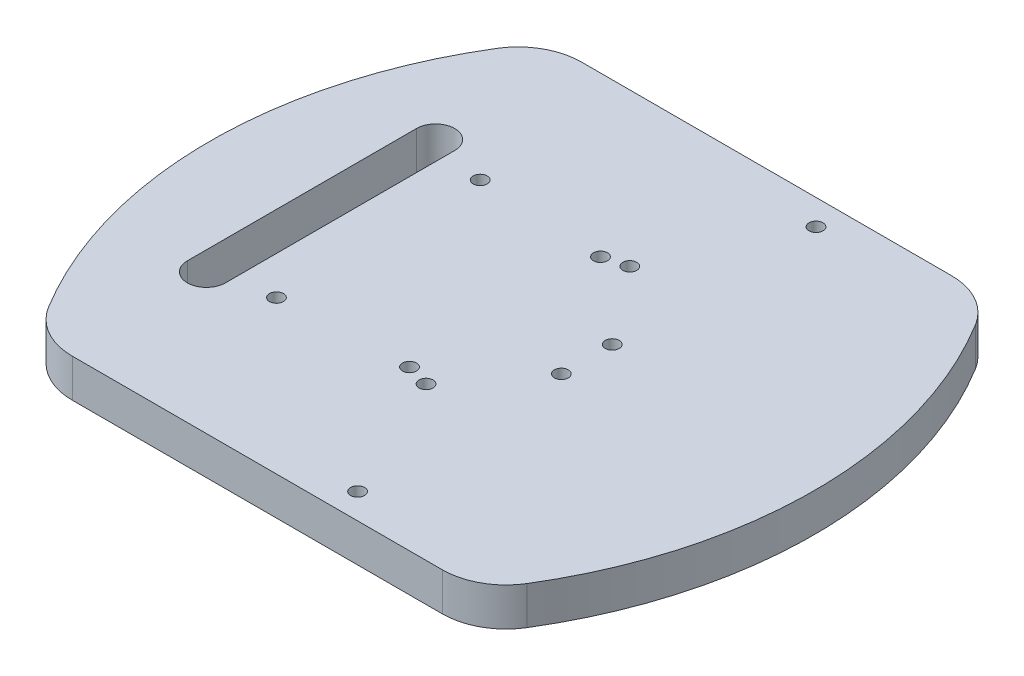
ISO-10303-21;
HEADER;
FILE_DESCRIPTION(('STEP AP214'),'2;1');
FILE_NAME('part.step','',(''),(''),'','','');
FILE_SCHEMA(('AUTOMOTIVE_DESIGN { 1 0 10303 214 1 1 1 1 }'));
ENDSEC;
DATA;
#1=APPLICATION_CONTEXT('core data for automotive mechanical design processes');
#2=APPLICATION_PROTOCOL_DEFINITION('international standard','automotive_design',2000,#1);
#3=PRODUCT_CONTEXT('',#1,'mechanical');
#4=PRODUCT('Part','Part','',(#3));
#5=PRODUCT_RELATED_PRODUCT_CATEGORY('part','',(#4));
#6=PRODUCT_DEFINITION_FORMATION('','',#4);
#7=PRODUCT_DEFINITION_CONTEXT('part definition',#1,'design');
#8=PRODUCT_DEFINITION('design','',#6,#7);
#9=PRODUCT_DEFINITION_SHAPE('','',#8);
#10=(LENGTH_UNIT() NAMED_UNIT(*) SI_UNIT(.MILLI.,.METRE.));
#11=(NAMED_UNIT(*) PLANE_ANGLE_UNIT() SI_UNIT($,.RADIAN.));
#12=(NAMED_UNIT(*) SI_UNIT($,.STERADIAN.) SOLID_ANGLE_UNIT());
#13=UNCERTAINTY_MEASURE_WITH_UNIT(LENGTH_MEASURE(1.E-05),#10,'distance_accuracy_value','');
#14=(GEOMETRIC_REPRESENTATION_CONTEXT(3) GLOBAL_UNCERTAINTY_ASSIGNED_CONTEXT((#13)) GLOBAL_UNIT_ASSIGNED_CONTEXT((#10,
#11,#12)) REPRESENTATION_CONTEXT('',''));
#15=CARTESIAN_POINT('',(0.,0.,0.));
#16=DIRECTION('',(0.,0.,1.));
#17=DIRECTION('',(1.,0.,0.));
#18=AXIS2_PLACEMENT_3D('',#15,#16,#17);
#19=CARTESIAN_POINT('',(-34.0535421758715,6.,30.));
#20=DIRECTION('',(0.,1.,0.));
#21=DIRECTION('',(0.,0.,1.));
#22=AXIS2_PLACEMENT_3D('',#19,#20,#21);
#23=PLANE('',#22);
#24=CARTESIAN_POINT('',(-6.1,6.,-15.));
#25=DIRECTION('',(0.,1.,0.));
#26=DIRECTION('',(0.,0.,1.));
#27=AXIS2_PLACEMENT_3D('',#24,#25,#26);
#28=CIRCLE('',#27,1.1);
#29=CARTESIAN_POINT('',(-6.1,6.,-13.9));
#30=VERTEX_POINT('',#29);
#31=EDGE_CURVE('E142',#30,#30,#28,.T.);
#32=ORIENTED_EDGE('',*,*,#31,.F.);
#33=EDGE_LOOP('',(#32));
#34=FACE_BOUND('',#33,.T.);
#35=CARTESIAN_POINT('',(-26.,6.,16.));
#36=DIRECTION('',(0.,1.,0.));
#37=DIRECTION('',(0.,0.,-1.));
#38=AXIS2_PLACEMENT_3D('',#35,#36,#37);
#39=CIRCLE('',#38,1.1);
#40=CARTESIAN_POINT('',(-26.,6.,14.9));
#41=VERTEX_POINT('',#40);
#42=EDGE_CURVE('E164',#41,#41,#39,.T.);
#43=ORIENTED_EDGE('',*,*,#42,.F.);
#44=EDGE_LOOP('',(#43));
#45=FACE_BOUND('',#44,.T.);
#46=CARTESIAN_POINT('',(-26.,6.,-16.));
#47=DIRECTION('',(0.,1.,0.));
#48=DIRECTION('',(0.,0.,1.));
#49=AXIS2_PLACEMENT_3D('',#46,#47,#48);
#50=CIRCLE('',#49,1.1);
#51=CARTESIAN_POINT('',(-26.,6.,-14.9));
#52=VERTEX_POINT('',#51);
#53=EDGE_CURVE('E176',#52,#52,#50,.T.);
#54=ORIENTED_EDGE('',*,*,#53,.F.);
#55=EDGE_LOOP('',(#54));
#56=FACE_BOUND('',#55,.T.);
#57=CARTESIAN_POINT('',(6.75,6.,4.));
#58=DIRECTION('',(0.,1.,0.));
#59=DIRECTION('',(0.,0.,1.));
#60=AXIS2_PLACEMENT_3D('',#57,#58,#59);
#61=CIRCLE('',#60,1.1);
#62=CARTESIAN_POINT('',(6.75,6.,5.1));
#63=VERTEX_POINT('',#62);
#64=EDGE_CURVE('E188',#63,#63,#61,.T.);
#65=ORIENTED_EDGE('',*,*,#64,.F.);
#66=EDGE_LOOP('',(#65));
#67=FACE_BOUND('',#66,.T.);
#68=CARTESIAN_POINT('',(6.75,6.,-4.));
#69=DIRECTION('',(0.,1.,0.));
#70=DIRECTION('',(0.,0.,-1.));
#71=AXIS2_PLACEMENT_3D('',#68,#69,#70);
#72=CIRCLE('',#71,1.1);
#73=CARTESIAN_POINT('',(6.75,6.,-5.1));
#74=VERTEX_POINT('',#73);
#75=EDGE_CURVE('E200',#74,#74,#72,.T.);
#76=ORIENTED_EDGE('',*,*,#75,.F.);
#77=EDGE_LOOP('',(#76));
#78=FACE_BOUND('',#77,.T.);
#79=CARTESIAN_POINT('',(-34.0535421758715,6.,30.));
#80=DIRECTION('',(0.,1.,0.));
#81=DIRECTION('',(0.,0.,1.));
#82=AXIS2_PLACEMENT_3D('',#79,#80,#81);
#83=CIRCLE('',#82,10.);
#84=CARTESIAN_POINT('',(-42.5845929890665,6.,35.2173913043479));
#85=VERTEX_POINT('',#84);
#86=CARTESIAN_POINT('',(-34.0535421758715,6.,40.));
#87=VERTEX_POINT('',#86);
#88=EDGE_CURVE('E226',#85,#87,#83,.T.);
#89=ORIENTED_EDGE('',*,*,#88,.T.);
#90=DIRECTION('',(1.,0.,0.));
#91=VECTOR('',#90,1.);
#92=CARTESIAN_POINT('',(-34.0535421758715,6.,40.));
#93=LINE('',#92,#91);
#94=CARTESIAN_POINT('',(24.0535421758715,6.,40.0000000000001));
#95=VERTEX_POINT('',#94);
#96=EDGE_CURVE('E229',#87,#95,#93,.T.);
#97=ORIENTED_EDGE('',*,*,#96,.T.);
#98=CARTESIAN_POINT('',(24.0535421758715,6.,30.0000000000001));
#99=DIRECTION('',(0.,1.,0.));
#100=DIRECTION('',(0.,0.,-1.));
#101=AXIS2_PLACEMENT_3D('',#98,#99,#100);
#102=CIRCLE('',#101,10.);
#103=CARTESIAN_POINT('',(32.5845929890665,6.,35.2173913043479));
#104=VERTEX_POINT('',#103);
#105=EDGE_CURVE('E231',#95,#104,#102,.T.);
#106=ORIENTED_EDGE('',*,*,#105,.T.);
#107=CARTESIAN_POINT('',(-25.,6.,0.));
#108=DIRECTION('',(0.,1.,0.));
#109=DIRECTION('',(0.,0.,1.));
#110=AXIS2_PLACEMENT_3D('',#107,#108,#109);
#111=CIRCLE('',#110,67.5);
#112=CARTESIAN_POINT('',(32.5845929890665,6.,-35.2173913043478));
#113=VERTEX_POINT('',#112);
#114=EDGE_CURVE('E233',#104,#113,#111,.T.);
#115=ORIENTED_EDGE('',*,*,#114,.T.);
#116=CARTESIAN_POINT('',(24.0535421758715,6.,-29.9999999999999));
#117=DIRECTION('',(0.,1.,0.));
#118=DIRECTION('',(0.,0.,-1.));
#119=AXIS2_PLACEMENT_3D('',#116,#117,#118);
#120=CIRCLE('',#119,10.);
#121=CARTESIAN_POINT('',(24.0535421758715,6.,-39.9999999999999));
#122=VERTEX_POINT('',#121);
#123=EDGE_CURVE('E235',#113,#122,#120,.T.);
#124=ORIENTED_EDGE('',*,*,#123,.T.);
#125=DIRECTION('',(-1.,0.,0.));
#126=VECTOR('',#125,1.);
#127=CARTESIAN_POINT('',(-34.0535421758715,6.,-40.));
#128=LINE('',#127,#126);
#129=CARTESIAN_POINT('',(-34.0535421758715,6.,-40.));
#130=VERTEX_POINT('',#129);
#131=EDGE_CURVE('E237',#122,#130,#128,.T.);
#132=ORIENTED_EDGE('',*,*,#131,.T.);
#133=CARTESIAN_POINT('',(-34.0535421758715,6.,-30.));
#134=DIRECTION('',(0.,1.,0.));
#135=DIRECTION('',(0.,0.,1.));
#136=AXIS2_PLACEMENT_3D('',#133,#134,#135);
#137=CIRCLE('',#136,10.);
#138=CARTESIAN_POINT('',(-42.5845929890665,6.,-35.2173913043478));
#139=VERTEX_POINT('',#138);
#140=EDGE_CURVE('E239',#130,#139,#137,.T.);
#141=ORIENTED_EDGE('',*,*,#140,.T.);
#142=CARTESIAN_POINT('',(15.,6.,0.));
#143=DIRECTION('',(0.,1.,0.));
#144=DIRECTION('',(0.,0.,-1.));
#145=AXIS2_PLACEMENT_3D('',#142,#143,#144);
#146=CIRCLE('',#145,67.5);
#147=EDGE_CURVE('E241',#139,#85,#146,.T.);
#148=ORIENTED_EDGE('',*,*,#147,.T.);
#149=EDGE_LOOP('',(#89,#97,#106,#115,#124,#132,#141,#148));
#150=FACE_BOUND('',#149,.T.);
#151=CARTESIAN_POINT('',(6.75,6.,-36.));
#152=DIRECTION('',(0.,1.,0.));
#153=DIRECTION('',(0.,0.,1.));
#154=AXIS2_PLACEMENT_3D('',#151,#152,#153);
#155=CIRCLE('',#154,1.1);
#156=CARTESIAN_POINT('',(6.75,6.,-34.9));
#157=VERTEX_POINT('',#156);
#158=EDGE_CURVE('E206',#157,#157,#155,.T.);
#159=ORIENTED_EDGE('',*,*,#158,.F.);
#160=EDGE_LOOP('',(#159));
#161=FACE_BOUND('',#160,.T.);
#162=CARTESIAN_POINT('',(6.75,6.,36.));
#163=DIRECTION('',(0.,1.,0.));
#164=DIRECTION('',(0.,0.,-1.));
#165=AXIS2_PLACEMENT_3D('',#162,#163,#164);
#166=CIRCLE('',#165,1.1);
#167=CARTESIAN_POINT('',(6.75,6.,34.9));
#168=VERTEX_POINT('',#167);
#169=EDGE_CURVE('E194',#168,#168,#166,.T.);
#170=ORIENTED_EDGE('',*,*,#169,.F.);
#171=EDGE_LOOP('',(#170));
#172=FACE_BOUND('',#171,.T.);
#173=CARTESIAN_POINT('',(-2.49999999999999,6.,-16.));
#174=DIRECTION('',(0.,1.,0.));
#175=DIRECTION('',(0.,0.,1.));
#176=AXIS2_PLACEMENT_3D('',#173,#174,#175);
#177=CIRCLE('',#176,1.1);
#178=CARTESIAN_POINT('',(-2.49999999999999,6.,-14.9));
#179=VERTEX_POINT('',#178);
#180=EDGE_CURVE('E182',#179,#179,#177,.T.);
#181=ORIENTED_EDGE('',*,*,#180,.F.);
#182=EDGE_LOOP('',(#181));
#183=FACE_BOUND('',#182,.T.);
#184=CARTESIAN_POINT('',(-2.49999999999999,6.,16.));
#185=DIRECTION('',(0.,1.,0.));
#186=DIRECTION('',(0.,0.,-1.));
#187=AXIS2_PLACEMENT_3D('',#184,#185,#186);
#188=CIRCLE('',#187,1.1);
#189=CARTESIAN_POINT('',(-2.49999999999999,6.,14.9));
#190=VERTEX_POINT('',#189);
#191=EDGE_CURVE('E170',#190,#190,#188,.T.);
#192=ORIENTED_EDGE('',*,*,#191,.F.);
#193=EDGE_LOOP('',(#192));
#194=FACE_BOUND('',#193,.T.);
#195=DIRECTION('',(0.,0.,1.));
#196=VECTOR('',#195,1.);
#197=CARTESIAN_POINT('',(-38.,6.,-18.));
#198=LINE('',#197,#196);
#199=CARTESIAN_POINT('',(-38.,6.,-18.));
#200=VERTEX_POINT('',#199);
#201=CARTESIAN_POINT('',(-38.,6.,18.));
#202=VERTEX_POINT('',#201);
#203=EDGE_CURVE('E152',#200,#202,#198,.T.);
#204=ORIENTED_EDGE('',*,*,#203,.F.);
#205=CARTESIAN_POINT('',(-35.,6.,-18.));
#206=DIRECTION('',(0.,1.,0.));
#207=DIRECTION('',(0.,0.,1.));
#208=AXIS2_PLACEMENT_3D('',#205,#206,#207);
#209=CIRCLE('',#208,3.);
#210=CARTESIAN_POINT('',(-32.,6.,-18.));
#211=VERTEX_POINT('',#210);
#212=EDGE_CURVE('E135',#211,#200,#209,.T.);
#213=ORIENTED_EDGE('',*,*,#212,.F.);
#214=DIRECTION('',(0.,0.,-1.));
#215=VECTOR('',#214,1.);
#216=CARTESIAN_POINT('',(-32.,6.,-18.));
#217=LINE('',#216,#215);
#218=CARTESIAN_POINT('',(-32.,6.,18.));
#219=VERTEX_POINT('',#218);
#220=EDGE_CURVE('E156',#219,#211,#217,.T.);
#221=ORIENTED_EDGE('',*,*,#220,.F.);
#222=CARTESIAN_POINT('',(-35.,6.,18.));
#223=DIRECTION('',(0.,1.,0.));
#224=DIRECTION('',(0.,0.,-1.));
#225=AXIS2_PLACEMENT_3D('',#222,#223,#224);
#226=CIRCLE('',#225,3.);
#227=EDGE_CURVE('E154',#202,#219,#226,.T.);
#228=ORIENTED_EDGE('',*,*,#227,.F.);
#229=EDGE_LOOP('',(#204,#213,#221,#228));
#230=FACE_BOUND('',#229,.T.);
#231=CARTESIAN_POINT('',(-6.1,6.,15.));
#232=DIRECTION('',(0.,1.,0.));
#233=DIRECTION('',(0.,0.,-1.));
#234=AXIS2_PLACEMENT_3D('',#231,#232,#233);
#235=CIRCLE('',#234,1.1);
#236=CARTESIAN_POINT('',(-6.1,6.,13.9));
#237=VERTEX_POINT('',#236);
#238=EDGE_CURVE('E383',#237,#237,#235,.T.);
#239=ORIENTED_EDGE('',*,*,#238,.F.);
#240=EDGE_LOOP('',(#239));
#241=FACE_BOUND('',#240,.T.);
#242=ADVANCED_FACE('F31',(#34,#45,#56,#67,#78,#150,#161,#172,#183,#194,#230,#241),#23,.T.);
#243=CARTESIAN_POINT('',(-34.0535421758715,0.,30.));
#244=DIRECTION('',(0.,1.,0.));
#245=DIRECTION('',(0.,0.,1.));
#246=AXIS2_PLACEMENT_3D('',#243,#244,#245);
#247=PLANE('',#246);
#248=CARTESIAN_POINT('',(-6.1,0.,-15.));
#249=DIRECTION('',(0.,1.,0.));
#250=DIRECTION('',(0.,0.,1.));
#251=AXIS2_PLACEMENT_3D('',#248,#249,#250);
#252=CIRCLE('',#251,1.1);
#253=CARTESIAN_POINT('',(-6.1,0.,-13.9));
#254=VERTEX_POINT('',#253);
#255=EDGE_CURVE('E145',#254,#254,#252,.T.);
#256=ORIENTED_EDGE('',*,*,#255,.T.);
#257=EDGE_LOOP('',(#256));
#258=FACE_BOUND('',#257,.T.);
#259=CARTESIAN_POINT('',(-26.,0.,16.));
#260=DIRECTION('',(0.,1.,0.));
#261=DIRECTION('',(0.,0.,-1.));
#262=AXIS2_PLACEMENT_3D('',#259,#260,#261);
#263=CIRCLE('',#262,1.1);
#264=CARTESIAN_POINT('',(-26.,0.,14.9));
#265=VERTEX_POINT('',#264);
#266=EDGE_CURVE('E136',#265,#265,#263,.T.);
#267=ORIENTED_EDGE('',*,*,#266,.T.);
#268=EDGE_LOOP('',(#267));
#269=FACE_BOUND('',#268,.T.);
#270=CARTESIAN_POINT('',(-26.,0.,-16.));
#271=DIRECTION('',(0.,1.,0.));
#272=DIRECTION('',(0.,0.,1.));
#273=AXIS2_PLACEMENT_3D('',#270,#271,#272);
#274=CIRCLE('',#273,1.1);
#275=CARTESIAN_POINT('',(-26.,0.,-14.9));
#276=VERTEX_POINT('',#275);
#277=EDGE_CURVE('E173',#276,#276,#274,.T.);
#278=ORIENTED_EDGE('',*,*,#277,.T.);
#279=EDGE_LOOP('',(#278));
#280=FACE_BOUND('',#279,.T.);
#281=CARTESIAN_POINT('',(6.75,0.,4.));
#282=DIRECTION('',(0.,1.,0.));
#283=DIRECTION('',(0.,0.,1.));
#284=AXIS2_PLACEMENT_3D('',#281,#282,#283);
#285=CIRCLE('',#284,1.1);
#286=CARTESIAN_POINT('',(6.75,0.,5.1));
#287=VERTEX_POINT('',#286);
#288=EDGE_CURVE('E185',#287,#287,#285,.T.);
#289=ORIENTED_EDGE('',*,*,#288,.T.);
#290=EDGE_LOOP('',(#289));
#291=FACE_BOUND('',#290,.T.);
#292=CARTESIAN_POINT('',(6.75,0.,-4.));
#293=DIRECTION('',(0.,1.,0.));
#294=DIRECTION('',(0.,0.,-1.));
#295=AXIS2_PLACEMENT_3D('',#292,#293,#294);
#296=CIRCLE('',#295,1.1);
#297=CARTESIAN_POINT('',(6.75,0.,-5.1));
#298=VERTEX_POINT('',#297);
#299=EDGE_CURVE('E197',#298,#298,#296,.T.);
#300=ORIENTED_EDGE('',*,*,#299,.T.);
#301=EDGE_LOOP('',(#300));
#302=FACE_BOUND('',#301,.T.);
#303=CARTESIAN_POINT('',(-34.0535421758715,0.,30.));
#304=DIRECTION('',(0.,1.,0.));
#305=DIRECTION('',(0.,0.,1.));
#306=AXIS2_PLACEMENT_3D('',#303,#304,#305);
#307=CIRCLE('',#306,10.);
#308=CARTESIAN_POINT('',(-42.5845929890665,0.,35.2173913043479));
#309=VERTEX_POINT('',#308);
#310=CARTESIAN_POINT('',(-34.0535421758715,0.,40.));
#311=VERTEX_POINT('',#310);
#312=EDGE_CURVE('E209',#309,#311,#307,.T.);
#313=ORIENTED_EDGE('',*,*,#312,.F.);
#314=CARTESIAN_POINT('',(15.,0.,0.));
#315=DIRECTION('',(0.,1.,0.));
#316=DIRECTION('',(0.,0.,-1.));
#317=AXIS2_PLACEMENT_3D('',#314,#315,#316);
#318=CIRCLE('',#317,67.5);
#319=CARTESIAN_POINT('',(-42.5845929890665,0.,-35.2173913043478));
#320=VERTEX_POINT('',#319);
#321=EDGE_CURVE('E224',#320,#309,#318,.T.);
#322=ORIENTED_EDGE('',*,*,#321,.F.);
#323=CARTESIAN_POINT('',(-34.0535421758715,0.,-30.));
#324=DIRECTION('',(0.,1.,0.));
#325=DIRECTION('',(0.,0.,1.));
#326=AXIS2_PLACEMENT_3D('',#323,#324,#325);
#327=CIRCLE('',#326,10.);
#328=CARTESIAN_POINT('',(-34.0535421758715,0.,-40.));
#329=VERTEX_POINT('',#328);
#330=EDGE_CURVE('E222',#329,#320,#327,.T.);
#331=ORIENTED_EDGE('',*,*,#330,.F.);
#332=DIRECTION('',(-1.,0.,0.));
#333=VECTOR('',#332,1.);
#334=CARTESIAN_POINT('',(-34.0535421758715,0.,-40.));
#335=LINE('',#334,#333);
#336=CARTESIAN_POINT('',(24.0535421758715,0.,-39.9999999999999));
#337=VERTEX_POINT('',#336);
#338=EDGE_CURVE('E220',#337,#329,#335,.T.);
#339=ORIENTED_EDGE('',*,*,#338,.F.);
#340=CARTESIAN_POINT('',(24.0535421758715,0.,-29.9999999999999));
#341=DIRECTION('',(0.,1.,0.));
#342=DIRECTION('',(0.,0.,-1.));
#343=AXIS2_PLACEMENT_3D('',#340,#341,#342);
#344=CIRCLE('',#343,10.);
#345=CARTESIAN_POINT('',(32.5845929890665,0.,-35.2173913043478));
#346=VERTEX_POINT('',#345);
#347=EDGE_CURVE('E218',#346,#337,#344,.T.);
#348=ORIENTED_EDGE('',*,*,#347,.F.);
#349=CARTESIAN_POINT('',(-25.,0.,0.));
#350=DIRECTION('',(0.,1.,0.));
#351=DIRECTION('',(0.,0.,1.));
#352=AXIS2_PLACEMENT_3D('',#349,#350,#351);
#353=CIRCLE('',#352,67.5);
#354=CARTESIAN_POINT('',(32.5845929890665,0.,35.2173913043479));
#355=VERTEX_POINT('',#354);
#356=EDGE_CURVE('E216',#355,#346,#353,.T.);
#357=ORIENTED_EDGE('',*,*,#356,.F.);
#358=CARTESIAN_POINT('',(24.0535421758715,0.,30.0000000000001));
#359=DIRECTION('',(0.,1.,0.));
#360=DIRECTION('',(0.,0.,-1.));
#361=AXIS2_PLACEMENT_3D('',#358,#359,#360);
#362=CIRCLE('',#361,10.);
#363=CARTESIAN_POINT('',(24.0535421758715,0.,40.0000000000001));
#364=VERTEX_POINT('',#363);
#365=EDGE_CURVE('E214',#364,#355,#362,.T.);
#366=ORIENTED_EDGE('',*,*,#365,.F.);
#367=DIRECTION('',(1.,0.,0.));
#368=VECTOR('',#367,1.);
#369=CARTESIAN_POINT('',(-34.0535421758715,0.,40.));
#370=LINE('',#369,#368);
#371=EDGE_CURVE('E212',#311,#364,#370,.T.);
#372=ORIENTED_EDGE('',*,*,#371,.F.);
#373=EDGE_LOOP('',(#313,#322,#331,#339,#348,#357,#366,#372));
#374=FACE_BOUND('',#373,.T.);
#375=CARTESIAN_POINT('',(6.75,0.,-36.));
#376=DIRECTION('',(0.,1.,0.));
#377=DIRECTION('',(0.,0.,1.));
#378=AXIS2_PLACEMENT_3D('',#375,#376,#377);
#379=CIRCLE('',#378,1.1);
#380=CARTESIAN_POINT('',(6.75,0.,-34.9));
#381=VERTEX_POINT('',#380);
#382=EDGE_CURVE('E203',#381,#381,#379,.T.);
#383=ORIENTED_EDGE('',*,*,#382,.T.);
#384=EDGE_LOOP('',(#383));
#385=FACE_BOUND('',#384,.T.);
#386=CARTESIAN_POINT('',(6.75,0.,36.));
#387=DIRECTION('',(0.,1.,0.));
#388=DIRECTION('',(0.,0.,-1.));
#389=AXIS2_PLACEMENT_3D('',#386,#387,#388);
#390=CIRCLE('',#389,1.1);
#391=CARTESIAN_POINT('',(6.75,0.,34.9));
#392=VERTEX_POINT('',#391);
#393=EDGE_CURVE('E191',#392,#392,#390,.T.);
#394=ORIENTED_EDGE('',*,*,#393,.T.);
#395=EDGE_LOOP('',(#394));
#396=FACE_BOUND('',#395,.T.);
#397=CARTESIAN_POINT('',(-2.49999999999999,0.,-16.));
#398=DIRECTION('',(0.,1.,0.));
#399=DIRECTION('',(0.,0.,1.));
#400=AXIS2_PLACEMENT_3D('',#397,#398,#399);
#401=CIRCLE('',#400,1.1);
#402=CARTESIAN_POINT('',(-2.49999999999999,0.,-14.9));
#403=VERTEX_POINT('',#402);
#404=EDGE_CURVE('E179',#403,#403,#401,.T.);
#405=ORIENTED_EDGE('',*,*,#404,.T.);
#406=EDGE_LOOP('',(#405));
#407=FACE_BOUND('',#406,.T.);
#408=CARTESIAN_POINT('',(-2.49999999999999,0.,16.));
#409=DIRECTION('',(0.,1.,0.));
#410=DIRECTION('',(0.,0.,-1.));
#411=AXIS2_PLACEMENT_3D('',#408,#409,#410);
#412=CIRCLE('',#411,1.1);
#413=CARTESIAN_POINT('',(-2.49999999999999,0.,14.9));
#414=VERTEX_POINT('',#413);
#415=EDGE_CURVE('E167',#414,#414,#412,.T.);
#416=ORIENTED_EDGE('',*,*,#415,.T.);
#417=EDGE_LOOP('',(#416));
#418=FACE_BOUND('',#417,.T.);
#419=CARTESIAN_POINT('',(-35.,0.,-18.));
#420=DIRECTION('',(0.,1.,0.));
#421=DIRECTION('',(0.,0.,1.));
#422=AXIS2_PLACEMENT_3D('',#419,#420,#421);
#423=CIRCLE('',#422,3.);
#424=CARTESIAN_POINT('',(-32.,0.,-18.));
#425=VERTEX_POINT('',#424);
#426=CARTESIAN_POINT('',(-38.,0.,-18.));
#427=VERTEX_POINT('',#426);
#428=EDGE_CURVE('E54',#425,#427,#423,.T.);
#429=ORIENTED_EDGE('',*,*,#428,.T.);
#430=DIRECTION('',(0.,0.,1.));
#431=VECTOR('',#430,1.);
#432=CARTESIAN_POINT('',(-38.,0.,-18.));
#433=LINE('',#432,#431);
#434=CARTESIAN_POINT('',(-38.,0.,18.));
#435=VERTEX_POINT('',#434);
#436=EDGE_CURVE('E122',#427,#435,#433,.T.);
#437=ORIENTED_EDGE('',*,*,#436,.T.);
#438=CARTESIAN_POINT('',(-35.,0.,18.));
#439=DIRECTION('',(0.,1.,0.));
#440=DIRECTION('',(0.,0.,-1.));
#441=AXIS2_PLACEMENT_3D('',#438,#439,#440);
#442=CIRCLE('',#441,3.);
#443=CARTESIAN_POINT('',(-32.,0.,18.));
#444=VERTEX_POINT('',#443);
#445=EDGE_CURVE('E131',#435,#444,#442,.T.);
#446=ORIENTED_EDGE('',*,*,#445,.T.);
#447=DIRECTION('',(0.,0.,-1.));
#448=VECTOR('',#447,1.);
#449=CARTESIAN_POINT('',(-32.,0.,-18.));
#450=LINE('',#449,#448);
#451=EDGE_CURVE('E141',#444,#425,#450,.T.);
#452=ORIENTED_EDGE('',*,*,#451,.T.);
#453=EDGE_LOOP('',(#429,#437,#446,#452));
#454=FACE_BOUND('',#453,.T.);
#455=CARTESIAN_POINT('',(-6.1,0.,15.));
#456=DIRECTION('',(0.,1.,0.));
#457=DIRECTION('',(0.,0.,-1.));
#458=AXIS2_PLACEMENT_3D('',#455,#456,#457);
#459=CIRCLE('',#458,1.1);
#460=CARTESIAN_POINT('',(-6.1,0.,13.9));
#461=VERTEX_POINT('',#460);
#462=EDGE_CURVE('E386',#461,#461,#459,.T.);
#463=ORIENTED_EDGE('',*,*,#462,.T.);
#464=EDGE_LOOP('',(#463));
#465=FACE_BOUND('',#464,.T.);
#466=ADVANCED_FACE('F139',(#258,#269,#280,#291,#302,#374,#385,#396,#407,#418,#454,#465),#247,.F.);
#467=CARTESIAN_POINT('',(-34.0535421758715,6.,30.));
#468=DIRECTION('',(0.,-1.,0.));
#469=DIRECTION('',(0.,0.,-1.));
#470=AXIS2_PLACEMENT_3D('',#467,#468,#469);
#471=CYLINDRICAL_SURFACE('',#470,10.);
#472=ORIENTED_EDGE('',*,*,#312,.T.);
#473=DIRECTION('',(0.,-1.,0.));
#474=VECTOR('',#473,1.);
#475=CARTESIAN_POINT('',(-34.0535421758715,6.,40.));
#476=LINE('',#475,#474);
#477=EDGE_CURVE('E11',#87,#311,#476,.T.);
#478=ORIENTED_EDGE('',*,*,#477,.F.);
#479=ORIENTED_EDGE('',*,*,#88,.F.);
#480=DIRECTION('',(0.,-1.,0.));
#481=VECTOR('',#480,1.);
#482=CARTESIAN_POINT('',(-42.5845929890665,6.,35.2173913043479));
#483=LINE('',#482,#481);
#484=EDGE_CURVE('E243',#85,#309,#483,.T.);
#485=ORIENTED_EDGE('',*,*,#484,.T.);
#486=EDGE_LOOP('',(#472,#478,#479,#485));
#487=FACE_BOUND('',#486,.T.);
#488=ADVANCED_FACE('F33',(#487),#471,.T.);
#489=CARTESIAN_POINT('',(-34.0535421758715,6.,40.));
#490=DIRECTION('',(0.,0.,-1.));
#491=DIRECTION('',(-1.,0.,0.));
#492=AXIS2_PLACEMENT_3D('',#489,#490,#491);
#493=PLANE('',#492);
#494=ORIENTED_EDGE('',*,*,#371,.T.);
#495=DIRECTION('',(0.,-1.,0.));
#496=VECTOR('',#495,1.);
#497=CARTESIAN_POINT('',(24.0535421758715,6.,40.0000000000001));
#498=LINE('',#497,#496);
#499=EDGE_CURVE('E39',#95,#364,#498,.T.);
#500=ORIENTED_EDGE('',*,*,#499,.F.);
#501=ORIENTED_EDGE('',*,*,#96,.F.);
#502=ORIENTED_EDGE('',*,*,#477,.T.);
#503=EDGE_LOOP('',(#494,#500,#501,#502));
#504=FACE_BOUND('',#503,.T.);
#505=ADVANCED_FACE('F288',(#504),#493,.F.);
#506=CARTESIAN_POINT('',(24.0535421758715,6.,30.0000000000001));
#507=DIRECTION('',(0.,-1.,0.));
#508=DIRECTION('',(0.,0.,-1.));
#509=AXIS2_PLACEMENT_3D('',#506,#507,#508);
#510=CYLINDRICAL_SURFACE('',#509,10.);
#511=ORIENTED_EDGE('',*,*,#365,.T.);
#512=DIRECTION('',(0.,-1.,0.));
#513=VECTOR('',#512,1.);
#514=CARTESIAN_POINT('',(32.5845929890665,6.,35.2173913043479));
#515=LINE('',#514,#513);
#516=EDGE_CURVE('E258',#104,#355,#515,.T.);
#517=ORIENTED_EDGE('',*,*,#516,.F.);
#518=ORIENTED_EDGE('',*,*,#105,.F.);
#519=ORIENTED_EDGE('',*,*,#499,.T.);
#520=EDGE_LOOP('',(#511,#517,#518,#519));
#521=FACE_BOUND('',#520,.T.);
#522=ADVANCED_FACE('F265',(#521),#510,.T.);
#523=CARTESIAN_POINT('',(-25.,6.,0.));
#524=DIRECTION('',(0.,-1.,0.));
#525=DIRECTION('',(0.,0.,-1.));
#526=AXIS2_PLACEMENT_3D('',#523,#524,#525);
#527=CYLINDRICAL_SURFACE('',#526,67.5);
#528=ORIENTED_EDGE('',*,*,#356,.T.);
#529=DIRECTION('',(0.,-1.,0.));
#530=VECTOR('',#529,1.);
#531=CARTESIAN_POINT('',(32.5845929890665,6.,-35.2173913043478));
#532=LINE('',#531,#530);
#533=EDGE_CURVE('E255',#113,#346,#532,.T.);
#534=ORIENTED_EDGE('',*,*,#533,.F.);
#535=ORIENTED_EDGE('',*,*,#114,.F.);
#536=ORIENTED_EDGE('',*,*,#516,.T.);
#537=EDGE_LOOP('',(#528,#534,#535,#536));
#538=FACE_BOUND('',#537,.T.);
#539=ADVANCED_FACE('F276',(#538),#527,.T.);
#540=CARTESIAN_POINT('',(24.0535421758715,6.,-29.9999999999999));
#541=DIRECTION('',(0.,-1.,0.));
#542=DIRECTION('',(0.,0.,-1.));
#543=AXIS2_PLACEMENT_3D('',#540,#541,#542);
#544=CYLINDRICAL_SURFACE('',#543,10.);
#545=ORIENTED_EDGE('',*,*,#347,.T.);
#546=DIRECTION('',(0.,-1.,0.));
#547=VECTOR('',#546,1.);
#548=CARTESIAN_POINT('',(24.0535421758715,6.,-39.9999999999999));
#549=LINE('',#548,#547);
#550=EDGE_CURVE('E252',#122,#337,#549,.T.);
#551=ORIENTED_EDGE('',*,*,#550,.F.);
#552=ORIENTED_EDGE('',*,*,#123,.F.);
#553=ORIENTED_EDGE('',*,*,#533,.T.);
#554=EDGE_LOOP('',(#545,#551,#552,#553));
#555=FACE_BOUND('',#554,.T.);
#556=ADVANCED_FACE('F280',(#555),#544,.T.);
#557=CARTESIAN_POINT('',(-34.0535421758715,6.,-40.));
#558=DIRECTION('',(0.,0.,1.));
#559=DIRECTION('',(1.,0.,0.));
#560=AXIS2_PLACEMENT_3D('',#557,#558,#559);
#561=PLANE('',#560);
#562=ORIENTED_EDGE('',*,*,#338,.T.);
#563=DIRECTION('',(0.,-1.,0.));
#564=VECTOR('',#563,1.);
#565=CARTESIAN_POINT('',(-34.0535421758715,6.,-40.));
#566=LINE('',#565,#564);
#567=EDGE_CURVE('E249',#130,#329,#566,.T.);
#568=ORIENTED_EDGE('',*,*,#567,.F.);
#569=ORIENTED_EDGE('',*,*,#131,.F.);
#570=ORIENTED_EDGE('',*,*,#550,.T.);
#571=EDGE_LOOP('',(#562,#568,#569,#570));
#572=FACE_BOUND('',#571,.T.);
#573=ADVANCED_FACE('F301',(#572),#561,.F.);
#574=CARTESIAN_POINT('',(-34.0535421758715,6.,-30.));
#575=DIRECTION('',(0.,-1.,0.));
#576=DIRECTION('',(0.,0.,-1.));
#577=AXIS2_PLACEMENT_3D('',#574,#575,#576);
#578=CYLINDRICAL_SURFACE('',#577,10.);
#579=ORIENTED_EDGE('',*,*,#330,.T.);
#580=DIRECTION('',(0.,-1.,0.));
#581=VECTOR('',#580,1.);
#582=CARTESIAN_POINT('',(-42.5845929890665,6.,-35.2173913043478));
#583=LINE('',#582,#581);
#584=EDGE_CURVE('E246',#139,#320,#583,.T.);
#585=ORIENTED_EDGE('',*,*,#584,.F.);
#586=ORIENTED_EDGE('',*,*,#140,.F.);
#587=ORIENTED_EDGE('',*,*,#567,.T.);
#588=EDGE_LOOP('',(#579,#585,#586,#587));
#589=FACE_BOUND('',#588,.T.);
#590=ADVANCED_FACE('F299',(#589),#578,.T.);
#591=CARTESIAN_POINT('',(15.,6.,0.));
#592=DIRECTION('',(0.,-1.,0.));
#593=DIRECTION('',(0.,0.,-1.));
#594=AXIS2_PLACEMENT_3D('',#591,#592,#593);
#595=CYLINDRICAL_SURFACE('',#594,67.5);
#596=ORIENTED_EDGE('',*,*,#321,.T.);
#597=ORIENTED_EDGE('',*,*,#484,.F.);
#598=ORIENTED_EDGE('',*,*,#147,.F.);
#599=ORIENTED_EDGE('',*,*,#584,.T.);
#600=EDGE_LOOP('',(#596,#597,#598,#599));
#601=FACE_BOUND('',#600,.T.);
#602=ADVANCED_FACE('F294',(#601),#595,.T.);
#603=CARTESIAN_POINT('',(6.75,6.,-36.));
#604=DIRECTION('',(0.,-1.,0.));
#605=DIRECTION('',(0.,0.,-1.));
#606=AXIS2_PLACEMENT_3D('',#603,#604,#605);
#607=CYLINDRICAL_SURFACE('',#606,1.1);
#608=ORIENTED_EDGE('',*,*,#158,.T.);
#609=EDGE_LOOP('',(#608));
#610=FACE_BOUND('',#609,.T.);
#611=ORIENTED_EDGE('',*,*,#382,.F.);
#612=EDGE_LOOP('',(#611));
#613=FACE_BOUND('',#612,.T.);
#614=ADVANCED_FACE('F323',(#610,#613),#607,.F.);
#615=CARTESIAN_POINT('',(6.75,6.,-4.));
#616=DIRECTION('',(0.,-1.,0.));
#617=DIRECTION('',(0.,0.,-1.));
#618=AXIS2_PLACEMENT_3D('',#615,#616,#617);
#619=CYLINDRICAL_SURFACE('',#618,1.1);
#620=ORIENTED_EDGE('',*,*,#75,.T.);
#621=EDGE_LOOP('',(#620));
#622=FACE_BOUND('',#621,.T.);
#623=ORIENTED_EDGE('',*,*,#299,.F.);
#624=EDGE_LOOP('',(#623));
#625=FACE_BOUND('',#624,.T.);
#626=ADVANCED_FACE('F327',(#622,#625),#619,.F.);
#627=CARTESIAN_POINT('',(6.75,6.,36.));
#628=DIRECTION('',(0.,-1.,0.));
#629=DIRECTION('',(0.,0.,-1.));
#630=AXIS2_PLACEMENT_3D('',#627,#628,#629);
#631=CYLINDRICAL_SURFACE('',#630,1.1);
#632=ORIENTED_EDGE('',*,*,#169,.T.);
#633=EDGE_LOOP('',(#632));
#634=FACE_BOUND('',#633,.T.);
#635=ORIENTED_EDGE('',*,*,#393,.F.);
#636=EDGE_LOOP('',(#635));
#637=FACE_BOUND('',#636,.T.);
#638=ADVANCED_FACE('F332',(#634,#637),#631,.F.);
#639=CARTESIAN_POINT('',(6.75,6.,4.));
#640=DIRECTION('',(0.,-1.,0.));
#641=DIRECTION('',(0.,0.,-1.));
#642=AXIS2_PLACEMENT_3D('',#639,#640,#641);
#643=CYLINDRICAL_SURFACE('',#642,1.1);
#644=ORIENTED_EDGE('',*,*,#64,.T.);
#645=EDGE_LOOP('',(#644));
#646=FACE_BOUND('',#645,.T.);
#647=ORIENTED_EDGE('',*,*,#288,.F.);
#648=EDGE_LOOP('',(#647));
#649=FACE_BOUND('',#648,.T.);
#650=ADVANCED_FACE('F339',(#646,#649),#643,.F.);
#651=CARTESIAN_POINT('',(-2.49999999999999,6.,-16.));
#652=DIRECTION('',(0.,-1.,0.));
#653=DIRECTION('',(0.,0.,-1.));
#654=AXIS2_PLACEMENT_3D('',#651,#652,#653);
#655=CYLINDRICAL_SURFACE('',#654,1.1);
#656=ORIENTED_EDGE('',*,*,#180,.T.);
#657=EDGE_LOOP('',(#656));
#658=FACE_BOUND('',#657,.T.);
#659=ORIENTED_EDGE('',*,*,#404,.F.);
#660=EDGE_LOOP('',(#659));
#661=FACE_BOUND('',#660,.T.);
#662=ADVANCED_FACE('F343',(#658,#661),#655,.F.);
#663=CARTESIAN_POINT('',(-26.,6.,-16.));
#664=DIRECTION('',(0.,-1.,0.));
#665=DIRECTION('',(0.,0.,-1.));
#666=AXIS2_PLACEMENT_3D('',#663,#664,#665);
#667=CYLINDRICAL_SURFACE('',#666,1.1);
#668=ORIENTED_EDGE('',*,*,#53,.T.);
#669=EDGE_LOOP('',(#668));
#670=FACE_BOUND('',#669,.T.);
#671=ORIENTED_EDGE('',*,*,#277,.F.);
#672=EDGE_LOOP('',(#671));
#673=FACE_BOUND('',#672,.T.);
#674=ADVANCED_FACE('F347',(#670,#673),#667,.F.);
#675=CARTESIAN_POINT('',(-2.49999999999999,6.,16.));
#676=DIRECTION('',(0.,-1.,0.));
#677=DIRECTION('',(0.,0.,-1.));
#678=AXIS2_PLACEMENT_3D('',#675,#676,#677);
#679=CYLINDRICAL_SURFACE('',#678,1.1);
#680=ORIENTED_EDGE('',*,*,#191,.T.);
#681=EDGE_LOOP('',(#680));
#682=FACE_BOUND('',#681,.T.);
#683=ORIENTED_EDGE('',*,*,#415,.F.);
#684=EDGE_LOOP('',(#683));
#685=FACE_BOUND('',#684,.T.);
#686=ADVANCED_FACE('F351',(#682,#685),#679,.F.);
#687=CARTESIAN_POINT('',(-26.,6.,16.));
#688=DIRECTION('',(0.,-1.,0.));
#689=DIRECTION('',(0.,0.,-1.));
#690=AXIS2_PLACEMENT_3D('',#687,#688,#689);
#691=CYLINDRICAL_SURFACE('',#690,1.1);
#692=ORIENTED_EDGE('',*,*,#42,.T.);
#693=EDGE_LOOP('',(#692));
#694=FACE_BOUND('',#693,.T.);
#695=ORIENTED_EDGE('',*,*,#266,.F.);
#696=EDGE_LOOP('',(#695));
#697=FACE_BOUND('',#696,.T.);
#698=ADVANCED_FACE('F355',(#694,#697),#691,.F.);
#699=CARTESIAN_POINT('',(-35.,6.,-18.));
#700=DIRECTION('',(0.,-1.,0.));
#701=DIRECTION('',(0.,0.,-1.));
#702=AXIS2_PLACEMENT_3D('',#699,#700,#701);
#703=CYLINDRICAL_SURFACE('',#702,3.);
#704=ORIENTED_EDGE('',*,*,#428,.F.);
#705=DIRECTION('',(0.,-1.,0.));
#706=VECTOR('',#705,1.);
#707=CARTESIAN_POINT('',(-32.,6.,-18.));
#708=LINE('',#707,#706);
#709=EDGE_CURVE('E158',#211,#425,#708,.T.);
#710=ORIENTED_EDGE('',*,*,#709,.F.);
#711=ORIENTED_EDGE('',*,*,#212,.T.);
#712=DIRECTION('',(0.,-1.,0.));
#713=VECTOR('',#712,1.);
#714=CARTESIAN_POINT('',(-38.,6.,-18.));
#715=LINE('',#714,#713);
#716=EDGE_CURVE('E124',#200,#427,#715,.T.);
#717=ORIENTED_EDGE('',*,*,#716,.T.);
#718=EDGE_LOOP('',(#704,#710,#711,#717));
#719=FACE_BOUND('',#718,.T.);
#720=ADVANCED_FACE('F133',(#719),#703,.F.);
#721=CARTESIAN_POINT('',(-38.,6.,-18.));
#722=DIRECTION('',(1.,0.,0.));
#723=DIRECTION('',(0.,0.,-1.));
#724=AXIS2_PLACEMENT_3D('',#721,#722,#723);
#725=PLANE('',#724);
#726=ORIENTED_EDGE('',*,*,#436,.F.);
#727=ORIENTED_EDGE('',*,*,#716,.F.);
#728=ORIENTED_EDGE('',*,*,#203,.T.);
#729=DIRECTION('',(0.,-1.,0.));
#730=VECTOR('',#729,1.);
#731=CARTESIAN_POINT('',(-38.,6.,18.));
#732=LINE('',#731,#730);
#733=EDGE_CURVE('E127',#202,#435,#732,.T.);
#734=ORIENTED_EDGE('',*,*,#733,.T.);
#735=EDGE_LOOP('',(#726,#727,#728,#734));
#736=FACE_BOUND('',#735,.T.);
#737=ADVANCED_FACE('F123',(#736),#725,.T.);
#738=CARTESIAN_POINT('',(-35.,6.,18.));
#739=DIRECTION('',(0.,-1.,0.));
#740=DIRECTION('',(0.,0.,-1.));
#741=AXIS2_PLACEMENT_3D('',#738,#739,#740);
#742=CYLINDRICAL_SURFACE('',#741,3.);
#743=ORIENTED_EDGE('',*,*,#445,.F.);
#744=ORIENTED_EDGE('',*,*,#733,.F.);
#745=ORIENTED_EDGE('',*,*,#227,.T.);
#746=DIRECTION('',(0.,-1.,0.));
#747=VECTOR('',#746,1.);
#748=CARTESIAN_POINT('',(-32.,6.,18.));
#749=LINE('',#748,#747);
#750=EDGE_CURVE('E46',#219,#444,#749,.T.);
#751=ORIENTED_EDGE('',*,*,#750,.T.);
#752=EDGE_LOOP('',(#743,#744,#745,#751));
#753=FACE_BOUND('',#752,.T.);
#754=ADVANCED_FACE('F364',(#753),#742,.F.);
#755=CARTESIAN_POINT('',(-32.,6.,-18.));
#756=DIRECTION('',(-1.,0.,0.));
#757=DIRECTION('',(0.,0.,1.));
#758=AXIS2_PLACEMENT_3D('',#755,#756,#757);
#759=PLANE('',#758);
#760=ORIENTED_EDGE('',*,*,#451,.F.);
#761=ORIENTED_EDGE('',*,*,#750,.F.);
#762=ORIENTED_EDGE('',*,*,#220,.T.);
#763=ORIENTED_EDGE('',*,*,#709,.T.);
#764=EDGE_LOOP('',(#760,#761,#762,#763));
#765=FACE_BOUND('',#764,.T.);
#766=ADVANCED_FACE('F367',(#765),#759,.T.);
#767=CARTESIAN_POINT('',(-6.1,6.,-15.));
#768=DIRECTION('',(0.,-1.,0.));
#769=DIRECTION('',(0.,0.,-1.));
#770=AXIS2_PLACEMENT_3D('',#767,#768,#769);
#771=CYLINDRICAL_SURFACE('',#770,1.1);
#772=ORIENTED_EDGE('',*,*,#31,.T.);
#773=EDGE_LOOP('',(#772));
#774=FACE_BOUND('',#773,.T.);
#775=ORIENTED_EDGE('',*,*,#255,.F.);
#776=EDGE_LOOP('',(#775));
#777=FACE_BOUND('',#776,.T.);
#778=ADVANCED_FACE('F371',(#774,#777),#771,.F.);
#779=CARTESIAN_POINT('',(-6.1,6.,15.));
#780=DIRECTION('',(0.,-1.,0.));
#781=DIRECTION('',(0.,0.,-1.));
#782=AXIS2_PLACEMENT_3D('',#779,#780,#781);
#783=CYLINDRICAL_SURFACE('',#782,1.1);
#784=ORIENTED_EDGE('',*,*,#238,.T.);
#785=EDGE_LOOP('',(#784));
#786=FACE_BOUND('',#785,.T.);
#787=ORIENTED_EDGE('',*,*,#462,.F.);
#788=EDGE_LOOP('',(#787));
#789=FACE_BOUND('',#788,.T.);
#790=ADVANCED_FACE('F374',(#786,#789),#783,.F.);
#791=CLOSED_SHELL('',(#242,#466,#488,#505,#522,#539,#556,#573,#590,#602,#614,#626,#638,#650,
#662,#674,#686,#698,#720,#737,#754,#766,#778,#790));
#792=MANIFOLD_SOLID_BREP('B2',#791);
#793=ADVANCED_BREP_SHAPE_REPRESENTATION('',(#18,#792),#14);
#794=SHAPE_DEFINITION_REPRESENTATION(#9,#793);
ENDSEC;
END-ISO-10303-21;
